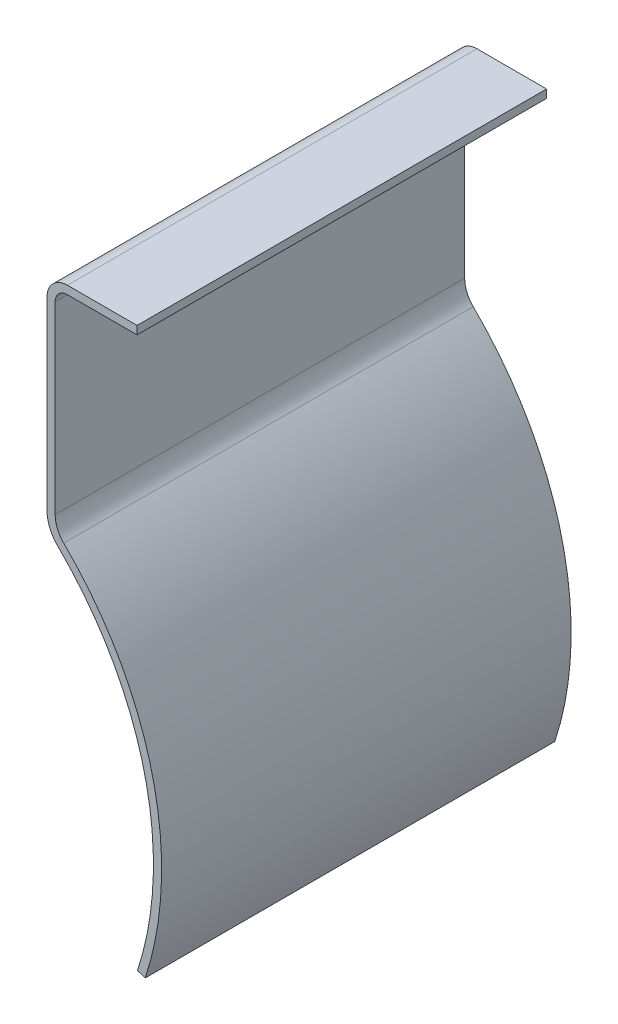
ISO-10303-21;
HEADER;
FILE_DESCRIPTION(('STEP AP214'),'2;1');
FILE_NAME('part.step','',(''),(''),'','','');
FILE_SCHEMA(('AUTOMOTIVE_DESIGN { 1 0 10303 214 1 1 1 1 }'));
ENDSEC;
DATA;
#1=APPLICATION_CONTEXT('core data for automotive mechanical design processes');
#2=APPLICATION_PROTOCOL_DEFINITION('international standard','automotive_design',2000,#1);
#3=PRODUCT_CONTEXT('',#1,'mechanical');
#4=PRODUCT('Part','Part','',(#3));
#5=PRODUCT_RELATED_PRODUCT_CATEGORY('part','',(#4));
#6=PRODUCT_DEFINITION_FORMATION('','',#4);
#7=PRODUCT_DEFINITION_CONTEXT('part definition',#1,'design');
#8=PRODUCT_DEFINITION('design','',#6,#7);
#9=PRODUCT_DEFINITION_SHAPE('','',#8);
#10=(LENGTH_UNIT() NAMED_UNIT(*) SI_UNIT(.MILLI.,.METRE.));
#11=(NAMED_UNIT(*) PLANE_ANGLE_UNIT() SI_UNIT($,.RADIAN.));
#12=(NAMED_UNIT(*) SI_UNIT($,.STERADIAN.) SOLID_ANGLE_UNIT());
#13=UNCERTAINTY_MEASURE_WITH_UNIT(LENGTH_MEASURE(1.E-05),#10,'distance_accuracy_value','');
#14=(GEOMETRIC_REPRESENTATION_CONTEXT(3) GLOBAL_UNCERTAINTY_ASSIGNED_CONTEXT((#13)) GLOBAL_UNIT_ASSIGNED_CONTEXT((#10,
#11,#12)) REPRESENTATION_CONTEXT('',''));
#15=CARTESIAN_POINT('',(0.,0.,0.));
#16=DIRECTION('',(0.,0.,1.));
#17=DIRECTION('',(1.,0.,0.));
#18=AXIS2_PLACEMENT_3D('',#15,#16,#17);
#19=CARTESIAN_POINT('',(0.,0.,5.));
#20=DIRECTION('',(-1.,0.,0.));
#21=DIRECTION('',(0.,0.,1.));
#22=AXIS2_PLACEMENT_3D('',#19,#20,#21);
#23=PLANE('',#22);
#24=DIRECTION('',(0.,1.,0.));
#25=VECTOR('',#24,1.);
#26=CARTESIAN_POINT('',(0.,0.,10.));
#27=LINE('',#26,#25);
#28=CARTESIAN_POINT('',(0.,0.,10.));
#29=VERTEX_POINT('',#28);
#30=CARTESIAN_POINT('',(0.,0.2,10.));
#31=VERTEX_POINT('',#30);
#32=EDGE_CURVE('E167',#29,#31,#27,.T.);
#33=ORIENTED_EDGE('',*,*,#32,.F.);
#34=DIRECTION('',(0.,0.,-1.));
#35=VECTOR('',#34,1.);
#36=CARTESIAN_POINT('',(0.,0.,0.));
#37=LINE('',#36,#35);
#38=CARTESIAN_POINT('',(0.,0.,0.));
#39=VERTEX_POINT('',#38);
#40=EDGE_CURVE('E97',#39,#29,#37,.F.);
#41=ORIENTED_EDGE('',*,*,#40,.F.);
#42=DIRECTION('',(0.,1.,0.));
#43=VECTOR('',#42,1.);
#44=CARTESIAN_POINT('',(0.,0.,0.));
#45=LINE('',#44,#43);
#46=CARTESIAN_POINT('',(0.,0.2,0.));
#47=VERTEX_POINT('',#46);
#48=EDGE_CURVE('E177',#47,#39,#45,.F.);
#49=ORIENTED_EDGE('',*,*,#48,.F.);
#50=DIRECTION('',(0.,0.,-1.));
#51=VECTOR('',#50,1.);
#52=CARTESIAN_POINT('',(0.,0.2,0.));
#53=LINE('',#52,#51);
#54=EDGE_CURVE('E166',#47,#31,#53,.F.);
#55=ORIENTED_EDGE('',*,*,#54,.T.);
#56=EDGE_LOOP('',(#33,#41,#49,#55));
#57=FACE_BOUND('',#56,.T.);
#58=ADVANCED_FACE('F16',(#57),#23,.F.);
#59=CARTESIAN_POINT('',(0.,0.2,0.));
#60=DIRECTION('',(0.,-1.,0.));
#61=DIRECTION('',(0.,0.,-1.));
#62=AXIS2_PLACEMENT_3D('',#59,#60,#61);
#63=PLANE('',#62);
#64=ORIENTED_EDGE('',*,*,#54,.F.);
#65=DIRECTION('',(1.,0.,0.));
#66=VECTOR('',#65,1.);
#67=CARTESIAN_POINT('',(0.,0.2,0.));
#68=LINE('',#67,#66);
#69=CARTESIAN_POINT('',(-1.7,0.2,0.));
#70=VERTEX_POINT('',#69);
#71=EDGE_CURVE('E163',#70,#47,#68,.T.);
#72=ORIENTED_EDGE('',*,*,#71,.F.);
#73=DIRECTION('',(0.,0.,1.));
#74=VECTOR('',#73,1.);
#75=CARTESIAN_POINT('',(-1.7,0.2,0.));
#76=LINE('',#75,#74);
#77=CARTESIAN_POINT('',(-1.7,0.2,10.));
#78=VERTEX_POINT('',#77);
#79=EDGE_CURVE('E96',#78,#70,#76,.F.);
#80=ORIENTED_EDGE('',*,*,#79,.F.);
#81=DIRECTION('',(1.,0.,0.));
#82=VECTOR('',#81,1.);
#83=CARTESIAN_POINT('',(0.,0.2,10.));
#84=LINE('',#83,#82);
#85=EDGE_CURVE('E92',#31,#78,#84,.F.);
#86=ORIENTED_EDGE('',*,*,#85,.F.);
#87=EDGE_LOOP('',(#64,#72,#80,#86));
#88=FACE_BOUND('',#87,.T.);
#89=ADVANCED_FACE('F250',(#88),#63,.F.);
#90=CARTESIAN_POINT('',(0.,0.,0.));
#91=DIRECTION('',(0.,-1.,0.));
#92=DIRECTION('',(0.,0.,-1.));
#93=AXIS2_PLACEMENT_3D('',#90,#91,#92);
#94=PLANE('',#93);
#95=DIRECTION('',(1.,0.,0.));
#96=VECTOR('',#95,1.);
#97=CARTESIAN_POINT('',(0.,0.,0.));
#98=LINE('',#97,#96);
#99=CARTESIAN_POINT('',(-1.7,0.,0.));
#100=VERTEX_POINT('',#99);
#101=EDGE_CURVE('E155',#100,#39,#98,.T.);
#102=ORIENTED_EDGE('',*,*,#101,.T.);
#103=ORIENTED_EDGE('',*,*,#40,.T.);
#104=DIRECTION('',(1.,0.,0.));
#105=VECTOR('',#104,1.);
#106=CARTESIAN_POINT('',(0.,0.,10.));
#107=LINE('',#106,#105);
#108=CARTESIAN_POINT('',(-1.7,0.,10.));
#109=VERTEX_POINT('',#108);
#110=EDGE_CURVE('E153',#29,#109,#107,.F.);
#111=ORIENTED_EDGE('',*,*,#110,.T.);
#112=DIRECTION('',(0.,0.,1.));
#113=VECTOR('',#112,1.);
#114=CARTESIAN_POINT('',(-1.7,0.,0.));
#115=LINE('',#114,#113);
#116=EDGE_CURVE('E148',#109,#100,#115,.F.);
#117=ORIENTED_EDGE('',*,*,#116,.T.);
#118=EDGE_LOOP('',(#102,#103,#111,#117));
#119=FACE_BOUND('',#118,.T.);
#120=ADVANCED_FACE('F237',(#119),#94,.T.);
#121=CARTESIAN_POINT('',(-1.7,-0.3,0.));
#122=DIRECTION('',(0.,0.,1.));
#123=DIRECTION('',(1.,0.,0.));
#124=AXIS2_PLACEMENT_3D('',#121,#122,#123);
#125=CYLINDRICAL_SURFACE('',#124,0.5);
#126=CARTESIAN_POINT('',(-1.7,-0.3,0.));
#127=DIRECTION('',(0.,0.,1.));
#128=DIRECTION('',(1.,0.,0.));
#129=AXIS2_PLACEMENT_3D('',#126,#127,#128);
#130=CIRCLE('',#129,0.5);
#131=CARTESIAN_POINT('',(-2.2,-0.3,0.));
#132=VERTEX_POINT('',#131);
#133=EDGE_CURVE('E102',#70,#132,#130,.T.);
#134=ORIENTED_EDGE('',*,*,#133,.T.);
#135=DIRECTION('',(0.,0.,-1.));
#136=VECTOR('',#135,1.);
#137=CARTESIAN_POINT('',(-2.2,-0.3,0.));
#138=LINE('',#137,#136);
#139=CARTESIAN_POINT('',(-2.2,-0.3,10.));
#140=VERTEX_POINT('',#139);
#141=EDGE_CURVE('E99',#132,#140,#138,.F.);
#142=ORIENTED_EDGE('',*,*,#141,.T.);
#143=CARTESIAN_POINT('',(-1.7,-0.3,10.));
#144=DIRECTION('',(0.,0.,1.));
#145=DIRECTION('',(1.,0.,0.));
#146=AXIS2_PLACEMENT_3D('',#143,#144,#145);
#147=CIRCLE('',#146,0.5);
#148=EDGE_CURVE('E20',#140,#78,#147,.F.);
#149=ORIENTED_EDGE('',*,*,#148,.T.);
#150=ORIENTED_EDGE('',*,*,#79,.T.);
#151=EDGE_LOOP('',(#134,#142,#149,#150));
#152=FACE_BOUND('',#151,.T.);
#153=ADVANCED_FACE('F100',(#152),#125,.T.);
#154=CARTESIAN_POINT('',(-1.3,-4.8,0.));
#155=DIRECTION('',(0.,0.,1.));
#156=DIRECTION('',(1.,0.,0.));
#157=AXIS2_PLACEMENT_3D('',#154,#155,#156);
#158=CYLINDRICAL_SURFACE('',#157,0.899999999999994);
#159=CARTESIAN_POINT('',(-1.3,-4.8,0.));
#160=DIRECTION('',(0.,0.,1.));
#161=DIRECTION('',(1.,0.,0.));
#162=AXIS2_PLACEMENT_3D('',#159,#160,#161);
#163=CIRCLE('',#162,0.899999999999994);
#164=CARTESIAN_POINT('',(-2.2,-4.8,0.));
#165=VERTEX_POINT('',#164);
#166=CARTESIAN_POINT('',(-1.93106593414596,-5.44168199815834,0.));
#167=VERTEX_POINT('',#166);
#168=EDGE_CURVE('E152',#165,#167,#163,.T.);
#169=ORIENTED_EDGE('',*,*,#168,.T.);
#170=DIRECTION('',(0.,0.,1.));
#171=VECTOR('',#170,1.);
#172=CARTESIAN_POINT('',(-1.93106593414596,-5.44168199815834,0.));
#173=LINE('',#172,#171);
#174=CARTESIAN_POINT('',(-1.93106593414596,-5.44168199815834,10.));
#175=VERTEX_POINT('',#174);
#176=EDGE_CURVE('E106',#167,#175,#173,.T.);
#177=ORIENTED_EDGE('',*,*,#176,.T.);
#178=CARTESIAN_POINT('',(-1.3,-4.8,10.));
#179=DIRECTION('',(0.,0.,1.));
#180=DIRECTION('',(1.,0.,0.));
#181=AXIS2_PLACEMENT_3D('',#178,#179,#180);
#182=CIRCLE('',#181,0.899999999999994);
#183=CARTESIAN_POINT('',(-2.2,-4.8,10.));
#184=VERTEX_POINT('',#183);
#185=EDGE_CURVE('E202',#175,#184,#182,.F.);
#186=ORIENTED_EDGE('',*,*,#185,.T.);
#187=DIRECTION('',(0.,0.,-1.));
#188=VECTOR('',#187,1.);
#189=CARTESIAN_POINT('',(-2.2,-4.8,0.));
#190=LINE('',#189,#188);
#191=EDGE_CURVE('E107',#184,#165,#190,.T.);
#192=ORIENTED_EDGE('',*,*,#191,.T.);
#193=EDGE_LOOP('',(#169,#177,#186,#192));
#194=FACE_BOUND('',#193,.T.);
#195=ADVANCED_FACE('F204',(#194),#158,.T.);
#196=CARTESIAN_POINT('',(-1.7,-0.3,0.));
#197=DIRECTION('',(0.,0.,1.));
#198=DIRECTION('',(1.,0.,0.));
#199=AXIS2_PLACEMENT_3D('',#196,#197,#198);
#200=CYLINDRICAL_SURFACE('',#199,0.3);
#201=DIRECTION('',(0.,0.,-1.));
#202=VECTOR('',#201,1.);
#203=CARTESIAN_POINT('',(-2.,-0.3,0.));
#204=LINE('',#203,#202);
#205=CARTESIAN_POINT('',(-2.,-0.3,0.));
#206=VERTEX_POINT('',#205);
#207=CARTESIAN_POINT('',(-2.,-0.3,10.));
#208=VERTEX_POINT('',#207);
#209=EDGE_CURVE('E124',#206,#208,#204,.F.);
#210=ORIENTED_EDGE('',*,*,#209,.F.);
#211=CARTESIAN_POINT('',(-1.7,-0.3,0.));
#212=DIRECTION('',(0.,0.,1.));
#213=DIRECTION('',(1.,0.,0.));
#214=AXIS2_PLACEMENT_3D('',#211,#212,#213);
#215=CIRCLE('',#214,0.3);
#216=EDGE_CURVE('E151',#100,#206,#215,.T.);
#217=ORIENTED_EDGE('',*,*,#216,.F.);
#218=ORIENTED_EDGE('',*,*,#116,.F.);
#219=CARTESIAN_POINT('',(-1.7,-0.3,10.));
#220=DIRECTION('',(0.,0.,1.));
#221=DIRECTION('',(1.,0.,0.));
#222=AXIS2_PLACEMENT_3D('',#219,#220,#221);
#223=CIRCLE('',#222,0.3);
#224=EDGE_CURVE('E147',#208,#109,#223,.F.);
#225=ORIENTED_EDGE('',*,*,#224,.F.);
#226=EDGE_LOOP('',(#210,#217,#218,#225));
#227=FACE_BOUND('',#226,.T.);
#228=ADVANCED_FACE('F232',(#227),#200,.F.);
#229=CARTESIAN_POINT('',(-2.2,-0.3,0.));
#230=DIRECTION('',(1.,0.,0.));
#231=DIRECTION('',(0.,0.,-1.));
#232=AXIS2_PLACEMENT_3D('',#229,#230,#231);
#233=PLANE('',#232);
#234=ORIENTED_EDGE('',*,*,#141,.F.);
#235=DIRECTION('',(0.,1.,0.));
#236=VECTOR('',#235,1.);
#237=CARTESIAN_POINT('',(-2.2,0.,0.));
#238=LINE('',#237,#236);
#239=EDGE_CURVE('E132',#132,#165,#238,.F.);
#240=ORIENTED_EDGE('',*,*,#239,.T.);
#241=ORIENTED_EDGE('',*,*,#191,.F.);
#242=DIRECTION('',(0.,1.,0.));
#243=VECTOR('',#242,1.);
#244=CARTESIAN_POINT('',(-2.2,0.,10.));
#245=LINE('',#244,#243);
#246=EDGE_CURVE('E89',#184,#140,#245,.T.);
#247=ORIENTED_EDGE('',*,*,#246,.T.);
#248=EDGE_LOOP('',(#234,#240,#241,#247));
#249=FACE_BOUND('',#248,.T.);
#250=ADVANCED_FACE('F110',(#249),#233,.F.);
#251=CARTESIAN_POINT('',(-7.40030403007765,-11.0029259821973,0.));
#252=DIRECTION('',(0.,0.,1.));
#253=DIRECTION('',(1.,0.,0.));
#254=AXIS2_PLACEMENT_3D('',#251,#252,#253);
#255=CYLINDRICAL_SURFACE('',#254,7.8);
#256=ORIENTED_EDGE('',*,*,#176,.F.);
#257=CARTESIAN_POINT('',(-7.40030403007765,-11.0029259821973,0.));
#258=DIRECTION('',(0.,0.,1.));
#259=DIRECTION('',(1.,0.,0.));
#260=AXIS2_PLACEMENT_3D('',#257,#258,#259);
#261=CIRCLE('',#260,7.8);
#262=CARTESIAN_POINT('',(0.0099923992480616,-13.4375731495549,0.));
#263=VERTEX_POINT('',#262);
#264=EDGE_CURVE('E131',#167,#263,#261,.F.);
#265=ORIENTED_EDGE('',*,*,#264,.T.);
#266=DIRECTION('',(0.,0.,1.));
#267=VECTOR('',#266,1.);
#268=CARTESIAN_POINT('',(0.0099923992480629,-13.4375731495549,5.));
#269=LINE('',#268,#267);
#270=CARTESIAN_POINT('',(0.00999239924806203,-13.4375731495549,10.));
#271=VERTEX_POINT('',#270);
#272=EDGE_CURVE('E116',#263,#271,#269,.T.);
#273=ORIENTED_EDGE('',*,*,#272,.T.);
#274=CARTESIAN_POINT('',(-7.40030403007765,-11.0029259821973,10.));
#275=DIRECTION('',(0.,0.,1.));
#276=DIRECTION('',(1.,0.,0.));
#277=AXIS2_PLACEMENT_3D('',#274,#275,#276);
#278=CIRCLE('',#277,7.8);
#279=EDGE_CURVE('E113',#271,#175,#278,.T.);
#280=ORIENTED_EDGE('',*,*,#279,.T.);
#281=EDGE_LOOP('',(#256,#265,#273,#280));
#282=FACE_BOUND('',#281,.T.);
#283=ADVANCED_FACE('F211',(#282),#255,.F.);
#284=CARTESIAN_POINT('',(-2.,-0.3,0.));
#285=DIRECTION('',(1.,0.,0.));
#286=DIRECTION('',(0.,0.,-1.));
#287=AXIS2_PLACEMENT_3D('',#284,#285,#286);
#288=PLANE('',#287);
#289=DIRECTION('',(0.,1.,0.));
#290=VECTOR('',#289,1.);
#291=CARTESIAN_POINT('',(-2.,0.,0.));
#292=LINE('',#291,#290);
#293=CARTESIAN_POINT('',(-2.,-4.8,0.));
#294=VERTEX_POINT('',#293);
#295=EDGE_CURVE('E125',#294,#206,#292,.T.);
#296=ORIENTED_EDGE('',*,*,#295,.T.);
#297=ORIENTED_EDGE('',*,*,#209,.T.);
#298=DIRECTION('',(0.,1.,0.));
#299=VECTOR('',#298,1.);
#300=CARTESIAN_POINT('',(-2.,0.,10.));
#301=LINE('',#300,#299);
#302=CARTESIAN_POINT('',(-2.,-4.8,10.));
#303=VERTEX_POINT('',#302);
#304=EDGE_CURVE('E119',#208,#303,#301,.F.);
#305=ORIENTED_EDGE('',*,*,#304,.T.);
#306=DIRECTION('',(0.,0.,1.));
#307=VECTOR('',#306,1.);
#308=CARTESIAN_POINT('',(-1.99999999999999,-4.8,0.));
#309=LINE('',#308,#307);
#310=EDGE_CURVE('E128',#303,#294,#309,.F.);
#311=ORIENTED_EDGE('',*,*,#310,.T.);
#312=EDGE_LOOP('',(#296,#297,#305,#311));
#313=FACE_BOUND('',#312,.T.);
#314=ADVANCED_FACE('F226',(#313),#288,.T.);
#315=CARTESIAN_POINT('',(-0.85,0.,10.));
#316=DIRECTION('',(0.,0.,-1.));
#317=DIRECTION('',(-1.,0.,0.));
#318=AXIS2_PLACEMENT_3D('',#315,#316,#317);
#319=PLANE('',#318);
#320=ORIENTED_EDGE('',*,*,#148,.F.);
#321=ORIENTED_EDGE('',*,*,#246,.F.);
#322=ORIENTED_EDGE('',*,*,#185,.F.);
#323=ORIENTED_EDGE('',*,*,#279,.F.);
#324=DIRECTION('',(-0.950038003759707,0.312134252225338,0.));
#325=VECTOR('',#324,1.);
#326=CARTESIAN_POINT('',(0.200000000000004,-13.5,10.));
#327=LINE('',#326,#325);
#328=CARTESIAN_POINT('',(0.200000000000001,-13.5,10.));
#329=VERTEX_POINT('',#328);
#330=EDGE_CURVE('E112',#271,#329,#327,.F.);
#331=ORIENTED_EDGE('',*,*,#330,.T.);
#332=CARTESIAN_POINT('',(-7.40030403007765,-11.0029259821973,10.));
#333=DIRECTION('',(0.,0.,1.));
#334=DIRECTION('',(1.,0.,0.));
#335=AXIS2_PLACEMENT_3D('',#332,#333,#334);
#336=CIRCLE('',#335,8.);
#337=CARTESIAN_POINT('',(-1.7908290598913,-5.2990859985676,10.));
#338=VERTEX_POINT('',#337);
#339=EDGE_CURVE('E136',#338,#329,#336,.F.);
#340=ORIENTED_EDGE('',*,*,#339,.F.);
#341=CARTESIAN_POINT('',(-1.3,-4.8,10.));
#342=DIRECTION('',(0.,0.,1.));
#343=DIRECTION('',(1.,0.,0.));
#344=AXIS2_PLACEMENT_3D('',#341,#342,#343);
#345=CIRCLE('',#344,0.699999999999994);
#346=EDGE_CURVE('E193',#338,#303,#345,.F.);
#347=ORIENTED_EDGE('',*,*,#346,.T.);
#348=ORIENTED_EDGE('',*,*,#304,.F.);
#349=ORIENTED_EDGE('',*,*,#224,.T.);
#350=ORIENTED_EDGE('',*,*,#110,.F.);
#351=ORIENTED_EDGE('',*,*,#32,.T.);
#352=ORIENTED_EDGE('',*,*,#85,.T.);
#353=EDGE_LOOP('',(#320,#321,#322,#323,#331,#340,#347,#348,#349,#350,#351,#352));
#354=FACE_BOUND('',#353,.T.);
#355=ADVANCED_FACE('F87',(#354),#319,.F.);
#356=CARTESIAN_POINT('',(0.200000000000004,-13.5,5.));
#357=DIRECTION('',(0.312134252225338,0.950038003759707,0.));
#358=DIRECTION('',(-0.950038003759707,0.312134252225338,0.));
#359=AXIS2_PLACEMENT_3D('',#356,#357,#358);
#360=PLANE('',#359);
#361=DIRECTION('',(0.950038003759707,-0.312134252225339,0.));
#362=VECTOR('',#361,1.);
#363=CARTESIAN_POINT('',(0.009992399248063,-13.4375731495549,0.));
#364=LINE('',#363,#362);
#365=CARTESIAN_POINT('',(0.200000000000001,-13.5,0.));
#366=VERTEX_POINT('',#365);
#367=EDGE_CURVE('E129',#263,#366,#364,.T.);
#368=ORIENTED_EDGE('',*,*,#367,.T.);
#369=DIRECTION('',(0.,0.,1.));
#370=VECTOR('',#369,1.);
#371=CARTESIAN_POINT('',(0.200000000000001,-13.5,0.));
#372=LINE('',#371,#370);
#373=EDGE_CURVE('E134',#329,#366,#372,.F.);
#374=ORIENTED_EDGE('',*,*,#373,.F.);
#375=ORIENTED_EDGE('',*,*,#330,.F.);
#376=ORIENTED_EDGE('',*,*,#272,.F.);
#377=EDGE_LOOP('',(#368,#374,#375,#376));
#378=FACE_BOUND('',#377,.T.);
#379=ADVANCED_FACE('F215',(#378),#360,.F.);
#380=CARTESIAN_POINT('',(-0.85,0.,0.));
#381=DIRECTION('',(0.,0.,1.));
#382=DIRECTION('',(1.,0.,0.));
#383=AXIS2_PLACEMENT_3D('',#380,#381,#382);
#384=PLANE('',#383);
#385=ORIENTED_EDGE('',*,*,#48,.T.);
#386=ORIENTED_EDGE('',*,*,#101,.F.);
#387=ORIENTED_EDGE('',*,*,#216,.T.);
#388=ORIENTED_EDGE('',*,*,#295,.F.);
#389=CARTESIAN_POINT('',(-1.3,-4.8,0.));
#390=DIRECTION('',(0.,0.,1.));
#391=DIRECTION('',(1.,0.,0.));
#392=AXIS2_PLACEMENT_3D('',#389,#390,#391);
#393=CIRCLE('',#392,0.699999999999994);
#394=CARTESIAN_POINT('',(-1.7908290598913,-5.2990859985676,0.));
#395=VERTEX_POINT('',#394);
#396=EDGE_CURVE('E35',#294,#395,#393,.T.);
#397=ORIENTED_EDGE('',*,*,#396,.T.);
#398=CARTESIAN_POINT('',(-7.40030403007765,-11.0029259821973,0.));
#399=DIRECTION('',(0.,0.,1.));
#400=DIRECTION('',(1.,0.,0.));
#401=AXIS2_PLACEMENT_3D('',#398,#399,#400);
#402=CIRCLE('',#401,8.);
#403=EDGE_CURVE('E26',#366,#395,#402,.T.);
#404=ORIENTED_EDGE('',*,*,#403,.F.);
#405=ORIENTED_EDGE('',*,*,#367,.F.);
#406=ORIENTED_EDGE('',*,*,#264,.F.);
#407=ORIENTED_EDGE('',*,*,#168,.F.);
#408=ORIENTED_EDGE('',*,*,#239,.F.);
#409=ORIENTED_EDGE('',*,*,#133,.F.);
#410=ORIENTED_EDGE('',*,*,#71,.T.);
#411=EDGE_LOOP('',(#385,#386,#387,#388,#397,#404,#405,#406,#407,#408,#409,#410));
#412=FACE_BOUND('',#411,.T.);
#413=ADVANCED_FACE('F227',(#412),#384,.F.);
#414=CARTESIAN_POINT('',(-1.3,-4.8,0.));
#415=DIRECTION('',(0.,0.,1.));
#416=DIRECTION('',(1.,0.,0.));
#417=AXIS2_PLACEMENT_3D('',#414,#415,#416);
#418=CYLINDRICAL_SURFACE('',#417,0.699999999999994);
#419=DIRECTION('',(0.,0.,1.));
#420=VECTOR('',#419,1.);
#421=CARTESIAN_POINT('',(-1.7908290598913,-5.2990859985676,0.));
#422=LINE('',#421,#420);
#423=EDGE_CURVE('E10',#395,#338,#422,.T.);
#424=ORIENTED_EDGE('',*,*,#423,.F.);
#425=ORIENTED_EDGE('',*,*,#396,.F.);
#426=ORIENTED_EDGE('',*,*,#310,.F.);
#427=ORIENTED_EDGE('',*,*,#346,.F.);
#428=EDGE_LOOP('',(#424,#425,#426,#427));
#429=FACE_BOUND('',#428,.T.);
#430=ADVANCED_FACE('F224',(#429),#418,.F.);
#431=CARTESIAN_POINT('',(-7.40030403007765,-11.0029259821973,0.));
#432=DIRECTION('',(0.,0.,1.));
#433=DIRECTION('',(1.,0.,0.));
#434=AXIS2_PLACEMENT_3D('',#431,#432,#433);
#435=CYLINDRICAL_SURFACE('',#434,8.);
#436=ORIENTED_EDGE('',*,*,#403,.T.);
#437=ORIENTED_EDGE('',*,*,#423,.T.);
#438=ORIENTED_EDGE('',*,*,#339,.T.);
#439=ORIENTED_EDGE('',*,*,#373,.T.);
#440=EDGE_LOOP('',(#436,#437,#438,#439));
#441=FACE_BOUND('',#440,.T.);
#442=ADVANCED_FACE('F18',(#441),#435,.T.);
#443=CLOSED_SHELL('',(#58,#89,#120,#153,#195,#228,#250,#283,#314,#355,#379,#413,#430,#442));
#444=MANIFOLD_SOLID_BREP('B1',#443);
#445=ADVANCED_BREP_SHAPE_REPRESENTATION('',(#18,#444),#14);
#446=SHAPE_DEFINITION_REPRESENTATION(#9,#445);
ENDSEC;
END-ISO-10303-21;
